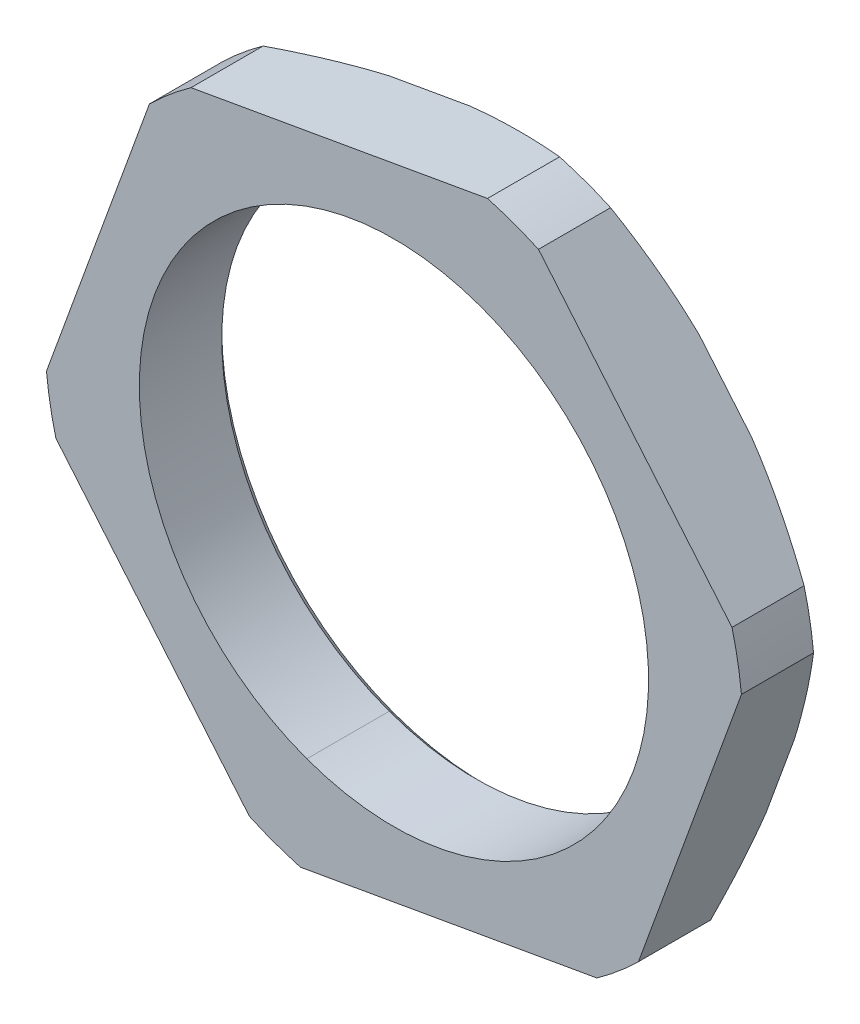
ISO-10303-21;
HEADER;
FILE_DESCRIPTION(('STEP AP214'),'2;1');
FILE_NAME('part.step','',(''),(''),'','','');
FILE_SCHEMA(('AUTOMOTIVE_DESIGN { 1 0 10303 214 1 1 1 1 }'));
ENDSEC;
DATA;
#1=APPLICATION_CONTEXT('core data for automotive mechanical design processes');
#2=APPLICATION_PROTOCOL_DEFINITION('international standard','automotive_design',2000,#1);
#3=PRODUCT_CONTEXT('',#1,'mechanical');
#4=PRODUCT('Part','Part','',(#3));
#5=PRODUCT_RELATED_PRODUCT_CATEGORY('part','',(#4));
#6=PRODUCT_DEFINITION_FORMATION('','',#4);
#7=PRODUCT_DEFINITION_CONTEXT('part definition',#1,'design');
#8=PRODUCT_DEFINITION('design','',#6,#7);
#9=PRODUCT_DEFINITION_SHAPE('','',#8);
#10=(LENGTH_UNIT() NAMED_UNIT(*) SI_UNIT(.MILLI.,.METRE.));
#11=(NAMED_UNIT(*) PLANE_ANGLE_UNIT() SI_UNIT($,.RADIAN.));
#12=(NAMED_UNIT(*) SI_UNIT($,.STERADIAN.) SOLID_ANGLE_UNIT());
#13=UNCERTAINTY_MEASURE_WITH_UNIT(LENGTH_MEASURE(1.E-05),#10,'distance_accuracy_value','');
#14=(GEOMETRIC_REPRESENTATION_CONTEXT(3) GLOBAL_UNCERTAINTY_ASSIGNED_CONTEXT((#13)) GLOBAL_UNIT_ASSIGNED_CONTEXT((#10,
#11,#12)) REPRESENTATION_CONTEXT('',''));
#15=CARTESIAN_POINT('',(0.,0.,0.));
#16=DIRECTION('',(0.,0.,1.));
#17=DIRECTION('',(1.,0.,0.));
#18=AXIS2_PLACEMENT_3D('',#15,#16,#17);
#19=CARTESIAN_POINT('',(0.,0.,-2.69733218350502));
#20=DIRECTION('',(0.,0.,1.));
#21=DIRECTION('',(-0.342020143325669,-0.939692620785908,0.));
#22=AXIS2_PLACEMENT_3D('',#19,#20,#21);
#23=CONICAL_SURFACE('',#22,50.,1.0471975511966);
#24=CARTESIAN_POINT('',(25.4760200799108,16.3105763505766,-14.1));
#25=CARTESIAN_POINT('',(25.7559586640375,15.9769188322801,-14.067765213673));
#26=CARTESIAN_POINT('',(26.0356091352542,15.6435416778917,-14.030217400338));
#27=CARTESIAN_POINT('',(26.5950178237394,14.9766788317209,-13.9446695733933));
#28=CARTESIAN_POINT('',(26.8747743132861,14.6431952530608,-13.8966417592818));
#29=CARTESIAN_POINT('',(27.4353780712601,13.9750956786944,-13.7901413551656));
#30=CARTESIAN_POINT('',(27.7162207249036,13.6404862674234,-13.731603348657));
#31=CARTESIAN_POINT('',(28.279807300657,12.9690262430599,-13.6041345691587));
#32=CARTESIAN_POINT('',(28.5625421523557,12.6321866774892,-13.5351057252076));
#33=CARTESIAN_POINT('',(29.1218936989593,11.9656089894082,-13.3889431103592));
#34=CARTESIAN_POINT('',(29.398529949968,11.6358508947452,-13.3119748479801));
#35=CARTESIAN_POINT('',(29.9532288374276,10.9746801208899,-13.1486224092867));
#36=CARTESIAN_POINT('',(30.2312821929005,10.6432789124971,-13.0621603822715));
#37=CARTESIAN_POINT('',(30.789461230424,9.9780767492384,-12.8798473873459));
#38=CARTESIAN_POINT('',(31.0695743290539,9.64429159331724,-12.7839004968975));
#39=CARTESIAN_POINT('',(31.6324375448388,8.97358394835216,-12.5826361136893));
#40=CARTESIAN_POINT('',(31.9151714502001,8.63668084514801,-12.4772085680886));
#41=CARTESIAN_POINT('',(32.1972691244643,8.30050365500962,-12.3679491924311));
#42=B_SPLINE_CURVE_WITH_KNOTS('',3,(#24,#25,#26,#27,#28,#29,#30,#31,#32,#33,#34,#35,#36,#37,#38,
#39,#40,#41),.UNSPECIFIED.,.F.,.F.,(4,2,2,2,2,2,2,2,4),(0.,1.31014422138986,2.6238070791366,
3.94594918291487,5.28131229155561,6.59298565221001,7.91635666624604,9.25483645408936,
10.6115906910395),.UNSPECIFIED.);
#43=CARTESIAN_POINT('',(25.4760200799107,16.3105763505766,-14.1));
#44=VERTEX_POINT('',#43);
#45=CARTESIAN_POINT('',(32.1972691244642,8.30050365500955,-12.3679491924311));
#46=VERTEX_POINT('',#45);
#47=EDGE_CURVE('E640',#44,#46,#42,.T.);
#48=ORIENTED_EDGE('',*,*,#47,.T.);
#49=CARTESIAN_POINT('',(0.,0.,-12.3679491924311));
#50=DIRECTION('',(0.,0.,-1.));
#51=DIRECTION('',(-0.342020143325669,-0.939692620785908,0.));
#52=AXIS2_PLACEMENT_3D('',#49,#50,#51);
#53=CIRCLE('',#52,33.25);
#54=CARTESIAN_POINT('',(33.0944756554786,3.21219256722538,-12.3679491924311));
#55=VERTEX_POINT('',#54);
#56=EDGE_CURVE('E637',#46,#55,#53,.T.);
#57=ORIENTED_EDGE('',*,*,#56,.T.);
#58=CARTESIAN_POINT('',(33.0944756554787,3.21219256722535,-12.3679491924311));
#59=CARTESIAN_POINT('',(32.9456044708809,2.80319737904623,-12.47630999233));
#60=CARTESIAN_POINT('',(32.7963902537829,2.39331699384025,-12.5809012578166));
#61=CARTESIAN_POINT('',(32.4993249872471,1.57729108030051,-12.7806547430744));
#62=CARTESIAN_POINT('',(32.3514823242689,1.17116871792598,-12.8759241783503));
#63=CARTESIAN_POINT('',(32.0568922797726,0.361804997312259,-13.057043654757));
#64=CARTESIAN_POINT('',(31.9101511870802,-0.0414176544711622,-13.1429872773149));
#65=CARTESIAN_POINT('',(31.6174248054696,-0.845868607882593,-13.3054636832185));
#66=CARTESIAN_POINT('',(31.4714442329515,-1.24708322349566,-13.382072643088));
#67=CARTESIAN_POINT('',(31.1737746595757,-2.06485527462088,-13.5288749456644));
#68=CARTESIAN_POINT('',(31.0220635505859,-2.48146144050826,-13.5987528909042));
#69=CARTESIAN_POINT('',(30.7196733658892,-3.31188971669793,-13.7277496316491));
#70=CARTESIAN_POINT('',(30.5689991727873,-3.72569791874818,-13.7869691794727));
#71=CARTESIAN_POINT('',(30.2682971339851,-4.55186824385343,-13.8946628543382));
#72=CARTESIAN_POINT('',(30.1182714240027,-4.9642223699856,-13.9432041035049));
#73=CARTESIAN_POINT('',(29.8182806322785,-5.78880227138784,-14.0296110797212));
#74=CARTESIAN_POINT('',(29.6683164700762,-6.20102541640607,-14.0675051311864));
#75=CARTESIAN_POINT('',(29.5181737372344,-6.61361619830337,-14.1));
#76=B_SPLINE_CURVE_WITH_KNOTS('',3,(#58,#59,#60,#61,#62,#63,#64,#65,#66,#67,#68,#69,#70,#71,#72,
#73,#74,#75),.UNSPECIFIED.,.F.,.F.,(4,2,2,2,2,2,2,2,4),(0.,1.34559695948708,2.6732346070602,
3.98599636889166,5.28720306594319,6.63362056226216,7.96655250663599,9.29084993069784,
10.6115902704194),.UNSPECIFIED.);
#77=CARTESIAN_POINT('',(29.5181737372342,-6.6136161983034,-14.1));
#78=VERTEX_POINT('',#77);
#79=EDGE_CURVE('E462',#55,#78,#76,.T.);
#80=ORIENTED_EDGE('',*,*,#79,.T.);
#81=CARTESIAN_POINT('',(0.,0.,-14.1));
#82=DIRECTION('',(0.,0.,1.));
#83=DIRECTION('',(-0.342020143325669,-0.939692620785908,0.));
#84=AXIS2_PLACEMENT_3D('',#81,#82,#83);
#85=CIRCLE('',#84,30.25);
#86=EDGE_CURVE('E437',#78,#44,#85,.T.);
#87=ORIENTED_EDGE('',*,*,#86,.T.);
#88=EDGE_LOOP('',(#48,#57,#80,#87));
#89=FACE_BOUND('',#88,.T.);
#90=ADVANCED_FACE('F15',(#89),#23,.T.);
#91=CARTESIAN_POINT('',(0.,0.,-2.69733218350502));
#92=DIRECTION('',(0.,0.,1.));
#93=DIRECTION('',(-0.342020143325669,-0.939692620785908,0.));
#94=AXIS2_PLACEMENT_3D('',#91,#92,#93);
#95=CONICAL_SURFACE('',#94,50.,1.0471975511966);
#96=CARTESIAN_POINT('',(26.8633835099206,-13.9075924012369,-14.1));
#97=CARTESIAN_POINT('',(26.7143484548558,-14.3169882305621,-14.0677546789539));
#98=CARTESIAN_POINT('',(26.565432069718,-14.7260000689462,-14.0301811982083));
#99=CARTESIAN_POINT('',(26.2675209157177,-15.5443352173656,-13.9445478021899));
#100=CARTESIAN_POINT('',(26.1185273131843,-15.9536556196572,-13.8964560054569));
#101=CARTESIAN_POINT('',(25.8200440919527,-16.773971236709,-13.7897932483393));
#102=CARTESIAN_POINT('',(25.6705580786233,-17.1849586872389,-13.7311526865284));
#103=CARTESIAN_POINT('',(25.3705086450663,-18.00986348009,-13.6034459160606));
#104=CARTESIAN_POINT('',(25.2199502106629,-18.423766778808,-13.5342775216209));
#105=CARTESIAN_POINT('',(24.9221858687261,-19.2418917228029,-13.3879763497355));
#106=CARTESIAN_POINT('',(24.7749723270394,-19.6461435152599,-13.3110272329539));
#107=CARTESIAN_POINT('',(24.4798568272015,-20.4565890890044,-13.1477521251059));
#108=CARTESIAN_POINT('',(24.3319598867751,-20.8627695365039,-13.0613509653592));
#109=CARTESIAN_POINT('',(24.0351699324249,-21.6780018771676,-12.8792000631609));
#110=CARTESIAN_POINT('',(23.8862841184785,-22.0870355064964,-12.783357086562));
#111=CARTESIAN_POINT('',(23.5871779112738,-22.9088309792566,-12.5823409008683));
#112=CARTESIAN_POINT('',(23.4369662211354,-23.3215697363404,-12.4770602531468));
#113=CARTESIAN_POINT('',(23.2870815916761,-23.7334011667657,-12.3679491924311));
#114=B_SPLINE_CURVE_WITH_KNOTS('',3,(#96,#97,#98,#99,#100,#101,#102,#103,#104,#105,#106,#107,
#108,#109,#110,#111,#112,#113),.UNSPECIFIED.,.F.,.F.,(4,2,2,2,2,2,2,2,4),(0.,1.31056980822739,
2.62516846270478,3.94878225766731,5.28617624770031,6.59723374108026,7.91960194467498,
9.25666808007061,10.6115764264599),.UNSPECIFIED.);
#115=CARTESIAN_POINT('',(26.8633835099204,-13.9075924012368,-14.1));
#116=VERTEX_POINT('',#115);
#117=CARTESIAN_POINT('',(23.287081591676,-23.7334011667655,-12.3679491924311));
#118=VERTEX_POINT('',#117);
#119=EDGE_CURVE('E461',#116,#118,#114,.T.);
#120=ORIENTED_EDGE('',*,*,#119,.T.);
#121=CARTESIAN_POINT('',(0.,0.,-12.3679491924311));
#122=DIRECTION('',(0.,0.,-1.));
#123=DIRECTION('',(-0.342020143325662,-0.939692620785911,0.));
#124=AXIS2_PLACEMENT_3D('',#121,#122,#123);
#125=CIRCLE('',#124,33.25);
#126=CARTESIAN_POINT('',(19.3290781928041,-27.0545603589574,-12.3679491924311));
#127=VERTEX_POINT('',#126);
#128=EDGE_CURVE('E518',#118,#127,#125,.T.);
#129=ORIENTED_EDGE('',*,*,#128,.T.);
#130=CARTESIAN_POINT('',(19.3290781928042,-27.0545603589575,-12.3679491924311));
#131=CARTESIAN_POINT('',(18.8989533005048,-27.130394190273,-12.4766864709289));
#132=CARTESIAN_POINT('',(18.4678836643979,-27.2063743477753,-12.5816281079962));
#133=CARTESIAN_POINT('',(17.6096883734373,-27.3576429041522,-12.7820151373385));
#134=CARTESIAN_POINT('',(17.1825872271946,-27.4329269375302,-12.8775688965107));
#135=CARTESIAN_POINT('',(16.3314459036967,-27.5830006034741,-13.0591899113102));
#136=CARTESIAN_POINT('',(15.907425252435,-27.6577862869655,-13.145351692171));
#137=CARTESIAN_POINT('',(15.061496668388,-27.8070137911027,-13.3081976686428));
#138=CARTESIAN_POINT('',(14.6396030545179,-27.8814528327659,-13.3849587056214));
#139=CARTESIAN_POINT('',(13.7825947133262,-28.0325432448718,-13.5314930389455));
#140=CARTESIAN_POINT('',(13.3474374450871,-28.1091987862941,-13.6010139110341));
#141=CARTESIAN_POINT('',(12.4800238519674,-28.262016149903,-13.7293681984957));
#142=CARTESIAN_POINT('',(12.0477818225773,-28.3381752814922,-13.7883011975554));
#143=CARTESIAN_POINT('',(11.1848599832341,-28.4903311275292,-13.8954933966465));
#144=CARTESIAN_POINT('',(10.7541880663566,-28.5663257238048,-13.9438189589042));
#145=CARTESIAN_POINT('',(9.89298631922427,-28.7183029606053,-14.0298652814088));
#146=CARTESIAN_POINT('',(9.46245919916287,-28.7942850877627,-14.0676141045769));
#147=CARTESIAN_POINT('',(9.03152723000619,-28.8702964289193,-14.1));
#148=B_SPLINE_CURVE_WITH_KNOTS('',3,(#130,#131,#132,#133,#134,#135,#136,#137,#138,#139,#140,
#141,#142,#143,#144,#145,#146,#147),.UNSPECIFIED.,.F.,.F.,(4,2,2,2,2,2,2,2,4),(0.,
1.35027160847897,2.6824575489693,3.99967535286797,5.30528327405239,6.64705256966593,
7.97545305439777,9.29528964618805,10.611590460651),.UNSPECIFIED.);
#149=CARTESIAN_POINT('',(9.03152723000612,-28.8702964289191,-14.1));
#150=VERTEX_POINT('',#149);
#151=EDGE_CURVE('E325',#127,#150,#148,.T.);
#152=ORIENTED_EDGE('',*,*,#151,.T.);
#153=CARTESIAN_POINT('',(0.,0.,-14.1));
#154=DIRECTION('',(0.,0.,1.));
#155=DIRECTION('',(-0.342020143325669,-0.939692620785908,0.));
#156=AXIS2_PLACEMENT_3D('',#153,#154,#155);
#157=CIRCLE('',#156,30.25);
#158=EDGE_CURVE('E424',#150,#116,#157,.T.);
#159=ORIENTED_EDGE('',*,*,#158,.T.);
#160=EDGE_LOOP('',(#120,#129,#152,#159));
#161=FACE_BOUND('',#160,.T.);
#162=ADVANCED_FACE('F545',(#161),#95,.T.);
#163=CARTESIAN_POINT('',(0.,0.,-2.69733218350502));
#164=DIRECTION('',(0.,0.,1.));
#165=DIRECTION('',(-0.342020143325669,-0.939692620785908,0.));
#166=AXIS2_PLACEMENT_3D('',#163,#164,#165);
#167=CONICAL_SURFACE('',#166,50.,1.0471975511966);
#168=CARTESIAN_POINT('',(13.7653974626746,30.2667529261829,-12.3679491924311));
#169=CARTESIAN_POINT('',(14.046133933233,29.9321707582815,-12.476686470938));
#170=CARTESIAN_POINT('',(14.3274694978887,29.5968435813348,-12.5816281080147));
#171=CARTESIAN_POINT('',(14.887569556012,28.9292589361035,-12.7820151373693));
#172=CARTESIAN_POINT('',(15.1663180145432,28.5970205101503,-12.8775688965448));
#173=CARTESIAN_POINT('',(15.7218562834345,27.9349473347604,-13.0591899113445));
#174=CARTESIAN_POINT('',(15.9986329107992,27.6051275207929,-13.1453516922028));
#175=CARTESIAN_POINT('',(16.5508320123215,26.9471456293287,-13.3081976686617));
#176=CARTESIAN_POINT('',(16.8262449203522,26.6189945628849,-13.3849587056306));
#177=CARTESIAN_POINT('',(17.3855972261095,25.9523487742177,-13.5314930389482));
#178=CARTESIAN_POINT('',(17.6695615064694,25.6138192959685,-13.6010139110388));
#179=CARTESIAN_POINT('',(18.235612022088,24.9390257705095,-13.7293681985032));
#180=CARTESIAN_POINT('',(18.5176887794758,24.6027727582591,-13.7883011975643));
#181=CARTESIAN_POINT('',(19.0809205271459,23.9315384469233,-13.8954933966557));
#182=CARTESIAN_POINT('',(19.3620697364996,23.5965629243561,-13.9438189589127));
#183=CARTESIAN_POINT('',(19.9242867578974,22.9267289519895,-14.0298652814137));
#184=CARTESIAN_POINT('',(20.2053527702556,22.5918725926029,-14.0676141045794));
#185=CARTESIAN_POINT('',(20.4866465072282,22.2566802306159,-14.1));
#186=B_SPLINE_CURVE_WITH_KNOTS('',3,(#168,#169,#170,#171,#172,#173,#174,#175,#176,#177,#178,
#179,#180,#181,#182,#183,#184,#185),.UNSPECIFIED.,.F.,.F.,(4,2,2,2,2,2,2,2,4),(0.,
1.35027160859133,2.68245754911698,3.99967535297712,5.30528327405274,6.64705256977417,
7.9754530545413,9.29528964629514,10.611590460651),.UNSPECIFIED.);
#187=CARTESIAN_POINT('',(13.7653974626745,30.2667529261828,-12.3679491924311));
#188=VERTEX_POINT('',#187);
#189=CARTESIAN_POINT('',(20.4866465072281,22.2566802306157,-14.1));
#190=VERTEX_POINT('',#189);
#191=EDGE_CURVE('E645',#188,#190,#186,.T.);
#192=ORIENTED_EDGE('',*,*,#191,.T.);
#193=CARTESIAN_POINT('',(0.,0.,-14.1));
#194=DIRECTION('',(0.,0.,1.));
#195=DIRECTION('',(-0.342020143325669,-0.939692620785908,0.));
#196=AXIS2_PLACEMENT_3D('',#193,#194,#195);
#197=CIRCLE('',#196,30.25);
#198=CARTESIAN_POINT('',(-1.38736343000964,30.2181687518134,-14.1));
#199=VERTEX_POINT('',#198);
#200=EDGE_CURVE('E698',#190,#199,#197,.T.);
#201=ORIENTED_EDGE('',*,*,#200,.T.);
#202=CARTESIAN_POINT('',(-1.38736343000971,30.2181687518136,-14.1));
#203=CARTESIAN_POINT('',(-0.958438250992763,30.293773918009,-14.067765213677));
#204=CARTESIAN_POINT('',(-0.52989993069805,30.3692697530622,-14.0302174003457));
#205=CARTESIAN_POINT('',(0.327324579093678,30.5203004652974,-13.9446695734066));
#206=CARTESIAN_POINT('',(0.756008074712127,30.5958349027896,-13.8966417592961));
#207=CARTESIAN_POINT('',(1.61490115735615,30.7472822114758,-13.7901413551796));
#208=CARTESIAN_POINT('',(2.04510273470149,30.8231943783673,-13.7316033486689));
#209=CARTESIAN_POINT('',(2.90839746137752,30.9755446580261,-13.6041345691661));
#210=CARTESIAN_POINT('',(3.34147650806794,31.0519804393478,-13.5351057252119));
#211=CARTESIAN_POINT('',(4.1984254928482,31.2031042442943,-13.3889431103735));
#212=CARTESIAN_POINT('',(4.6223225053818,31.2777992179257,-13.3119748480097));
#213=CARTESIAN_POINT('',(5.47226263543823,31.4275971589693,-13.1486224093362));
#214=CARTESIAN_POINT('',(5.89829117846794,31.5026978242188,-13.062160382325));
#215=CARTESIAN_POINT('',(6.75346266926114,31.6534939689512,-12.879847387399));
#216=CARTESIAN_POINT('',(7.18258564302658,31.7291864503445,-12.7839004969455));
#217=CARTESIAN_POINT('',(8.04486711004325,31.8812864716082,-12.5826361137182));
#218=CARTESIAN_POINT('',(8.47800070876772,31.957689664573,-12.4772085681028));
#219=CARTESIAN_POINT('',(8.91018753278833,32.0339048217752,-12.3679491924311));
#220=B_SPLINE_CURVE_WITH_KNOTS('',3,(#202,#203,#204,#205,#206,#207,#208,#209,#210,#211,#212,
#213,#214,#215,#216,#217,#218,#219),.UNSPECIFIED.,.F.,.F.,(4,2,2,2,2,2,2,2,4),(0.,
1.31014422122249,2.62380707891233,3.94594918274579,5.28131229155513,6.59298565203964,
7.91635666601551,9.25483645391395,10.6115906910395),.UNSPECIFIED.);
#221=CARTESIAN_POINT('',(8.91018753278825,32.0339048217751,-12.3679491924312));
#222=VERTEX_POINT('',#221);
#223=EDGE_CURVE('E238',#199,#222,#220,.T.);
#224=ORIENTED_EDGE('',*,*,#223,.T.);
#225=CARTESIAN_POINT('',(0.,0.,-12.3679491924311));
#226=DIRECTION('',(0.,0.,-1.));
#227=DIRECTION('',(-0.342020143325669,-0.939692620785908,0.));
#228=AXIS2_PLACEMENT_3D('',#225,#226,#227);
#229=CIRCLE('',#228,33.25);
#230=EDGE_CURVE('E427',#222,#188,#229,.T.);
#231=ORIENTED_EDGE('',*,*,#230,.T.);
#232=EDGE_LOOP('',(#192,#201,#224,#231));
#233=FACE_BOUND('',#232,.T.);
#234=ADVANCED_FACE('F553',(#233),#167,.T.);
#235=CARTESIAN_POINT('',(0.,0.,-2.69733218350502));
#236=DIRECTION('',(0.,0.,1.));
#237=DIRECTION('',(-0.342020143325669,-0.939692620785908,0.));
#238=AXIS2_PLACEMENT_3D('',#235,#236,#237);
#239=CONICAL_SURFACE('',#238,50.,1.0471975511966);
#240=CARTESIAN_POINT('',(-19.3290781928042,27.0545603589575,-12.3679491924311));
#241=CARTESIAN_POINT('',(-18.8989533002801,27.1303941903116,-12.4766864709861));
#242=CARTESIAN_POINT('',(-18.4678836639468,27.2063743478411,-12.5816281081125));
#243=CARTESIAN_POINT('',(-17.6096883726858,27.3576429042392,-12.7820151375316));
#244=CARTESIAN_POINT('',(-17.1825872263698,27.4329269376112,-12.8775688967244));
#245=CARTESIAN_POINT('',(-16.3314459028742,27.5830006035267,-13.0591899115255));
#246=CARTESIAN_POINT('',(-15.9074252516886,27.6577862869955,-13.1453516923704));
#247=CARTESIAN_POINT('',(-15.0614966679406,27.8070137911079,-13.3081976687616));
#248=CARTESIAN_POINT('',(-14.6396030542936,27.8814528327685,-13.3849587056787));
#249=CARTESIAN_POINT('',(-13.78259471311,28.0325432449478,-13.531493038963));
#250=CARTESIAN_POINT('',(-13.347437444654,28.1091987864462,-13.6010139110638));
#251=CARTESIAN_POINT('',(-12.4800238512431,28.2620161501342,-13.7293681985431));
#252=CARTESIAN_POINT('',(-12.0477818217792,28.3381752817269,-13.7883011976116));
#253=CARTESIAN_POINT('',(-11.1848599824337,28.4903311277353,-13.895493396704));
#254=CARTESIAN_POINT('',(-10.754188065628,28.5663257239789,-13.9438189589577));
#255=CARTESIAN_POINT('',(-9.89298631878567,28.7183029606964,-14.0298652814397));
#256=CARTESIAN_POINT('',(-9.46245919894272,28.7942850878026,-14.0676141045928));
#257=CARTESIAN_POINT('',(-9.0315272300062,28.8702964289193,-14.1));
#258=B_SPLINE_CURVE_WITH_KNOTS('',3,(#240,#241,#242,#243,#244,#245,#246,#247,#248,#249,#250,
#251,#252,#253,#254,#255,#256,#257),.UNSPECIFIED.,.F.,.F.,(4,2,2,2,2,2,2,2,4),(0.,
1.35027160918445,2.68245754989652,3.99967535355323,5.30528327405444,6.64705257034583,
7.97545305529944,9.29528964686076,10.6115904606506),.UNSPECIFIED.);
#259=CARTESIAN_POINT('',(-19.3290781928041,27.0545603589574,-12.3679491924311));
#260=VERTEX_POINT('',#259);
#261=CARTESIAN_POINT('',(-9.03152723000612,28.8702964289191,-14.1));
#262=VERTEX_POINT('',#261);
#263=EDGE_CURVE('E526',#260,#262,#258,.T.);
#264=ORIENTED_EDGE('',*,*,#263,.T.);
#265=CARTESIAN_POINT('',(0.,0.,-14.1));
#266=DIRECTION('',(0.,0.,1.));
#267=DIRECTION('',(-0.342020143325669,-0.939692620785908,0.));
#268=AXIS2_PLACEMENT_3D('',#265,#266,#267);
#269=CIRCLE('',#268,30.25);
#270=CARTESIAN_POINT('',(-26.8633835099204,13.9075924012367,-14.1));
#271=VERTEX_POINT('',#270);
#272=EDGE_CURVE('E212',#262,#271,#269,.T.);
#273=ORIENTED_EDGE('',*,*,#272,.T.);
#274=CARTESIAN_POINT('',(-26.8633835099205,13.9075924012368,-14.1));
#275=CARTESIAN_POINT('',(-26.7143484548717,14.316988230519,-14.0677546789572));
#276=CARTESIAN_POINT('',(-26.565432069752,14.7260000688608,-14.0301811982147));
#277=CARTESIAN_POINT('',(-26.2675209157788,15.5443352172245,-13.9445478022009));
#278=CARTESIAN_POINT('',(-26.1185273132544,15.9536556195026,-13.8964560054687));
#279=CARTESIAN_POINT('',(-25.8200440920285,16.773971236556,-13.7897932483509));
#280=CARTESIAN_POINT('',(-25.6705580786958,17.1849586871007,-13.7311526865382));
#281=CARTESIAN_POINT('',(-25.3705086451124,18.0098634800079,-13.6034459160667));
#282=CARTESIAN_POINT('',(-25.219950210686,18.423766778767,-13.5342775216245));
#283=CARTESIAN_POINT('',(-24.9221858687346,19.2418917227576,-13.3879763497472));
#284=CARTESIAN_POINT('',(-24.7749723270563,19.6461435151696,-13.3110272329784));
#285=CARTESIAN_POINT('',(-24.4798568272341,20.4565890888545,-13.1477521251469));
#286=CARTESIAN_POINT('',(-24.331959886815,20.8627695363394,-13.0613509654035));
#287=CARTESIAN_POINT('',(-24.0351699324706,21.6780018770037,-12.8792000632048));
#288=CARTESIAN_POINT('',(-23.8862841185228,22.0870355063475,-12.7833570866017));
#289=CARTESIAN_POINT('',(-23.5871779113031,22.9088309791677,-12.5823409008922));
#290=CARTESIAN_POINT('',(-23.4369662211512,23.3215697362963,-12.4770602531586));
#291=CARTESIAN_POINT('',(-23.2870815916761,23.7334011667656,-12.3679491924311));
#292=B_SPLINE_CURVE_WITH_KNOTS('',3,(#274,#275,#276,#277,#278,#279,#280,#281,#282,#283,#284,
#285,#286,#287,#288,#289,#290,#291),.UNSPECIFIED.,.F.,.F.,(4,2,2,2,2,2,2,2,4),(0.,
1.31056980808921,2.62516846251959,3.94878225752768,5.28617624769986,6.59723374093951,
7.9196019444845,9.25666807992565,10.6115764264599),.UNSPECIFIED.);
#293=CARTESIAN_POINT('',(-23.287081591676,23.7334011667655,-12.3679491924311));
#294=VERTEX_POINT('',#293);
#295=EDGE_CURVE('E204',#271,#294,#292,.T.);
#296=ORIENTED_EDGE('',*,*,#295,.T.);
#297=CARTESIAN_POINT('',(0.,0.,-12.3679491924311));
#298=DIRECTION('',(0.,0.,-1.));
#299=DIRECTION('',(-0.342020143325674,-0.939692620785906,0.));
#300=AXIS2_PLACEMENT_3D('',#297,#298,#299);
#301=CIRCLE('',#300,33.25);
#302=EDGE_CURVE('E209',#294,#260,#301,.T.);
#303=ORIENTED_EDGE('',*,*,#302,.T.);
#304=EDGE_LOOP('',(#264,#273,#296,#303));
#305=FACE_BOUND('',#304,.T.);
#306=ADVANCED_FACE('F207',(#305),#239,.T.);
#307=CARTESIAN_POINT('',(0.,0.,-2.69733218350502));
#308=DIRECTION('',(0.,0.,1.));
#309=DIRECTION('',(-0.342020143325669,-0.939692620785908,0.));
#310=AXIS2_PLACEMENT_3D('',#307,#308,#309);
#311=CONICAL_SURFACE('',#310,50.,1.0471975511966);
#312=DIRECTION('',(-0.296198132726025,-0.813797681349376,0.5));
#313=VECTOR('',#312,1.);
#314=CARTESIAN_POINT('',(-17.1010071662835,-46.9846310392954,-2.69733218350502));
#315=LINE('',#314,#313);
#316=CARTESIAN_POINT('',(-10.3461093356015,-28.4257017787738,-14.1));
#317=VERTEX_POINT('',#316);
#318=CARTESIAN_POINT('',(-11.3721697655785,-31.2447796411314,-12.3679491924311));
#319=VERTEX_POINT('',#318);
#320=EDGE_CURVE('E334',#317,#319,#315,.T.);
#321=ORIENTED_EDGE('',*,*,#320,.F.);
#322=CARTESIAN_POINT('',(0.,0.,-14.1));
#323=DIRECTION('',(0.,0.,1.));
#324=DIRECTION('',(-0.342020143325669,-0.939692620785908,0.));
#325=AXIS2_PLACEMENT_3D('',#322,#323,#324);
#326=CIRCLE('',#325,30.25);
#327=CARTESIAN_POINT('',(1.38736343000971,-30.2181687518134,-14.1));
#328=VERTEX_POINT('',#327);
#329=EDGE_CURVE('E579',#317,#328,#326,.T.);
#330=ORIENTED_EDGE('',*,*,#329,.T.);
#331=CARTESIAN_POINT('',(1.38736343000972,-30.2181687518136,-14.1));
#332=CARTESIAN_POINT('',(0.958438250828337,-30.2937739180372,-14.0677652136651));
#333=CARTESIAN_POINT('',(0.529899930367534,-30.3692697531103,-14.0302174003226));
#334=CARTESIAN_POINT('',(-0.327324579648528,-30.5203004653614,-13.9446695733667));
#335=CARTESIAN_POINT('',(-0.756008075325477,-30.5958349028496,-13.8966417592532));
#336=CARTESIAN_POINT('',(-1.61490115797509,-30.7472822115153,-13.7901413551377));
#337=CARTESIAN_POINT('',(-2.04510273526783,-30.8231943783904,-13.7316033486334));
#338=CARTESIAN_POINT('',(-2.90839746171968,-30.9755446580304,-13.6041345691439));
#339=CARTESIAN_POINT('',(-3.34147650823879,-31.0519804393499,-13.5351057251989));
#340=CARTESIAN_POINT('',(-4.1984254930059,-31.2031042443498,-13.3889431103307));
#341=CARTESIAN_POINT('',(-4.62232250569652,-31.2777992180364,-13.3119748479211));
#342=CARTESIAN_POINT('',(-5.47226263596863,-31.427597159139,-13.1486224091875));
#343=CARTESIAN_POINT('',(-5.8982911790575,-31.502697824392,-13.0621603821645));
#344=CARTESIAN_POINT('',(-6.75346266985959,-31.653493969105,-12.8798473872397));
#345=CARTESIAN_POINT('',(-7.18258564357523,-31.7291864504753,-12.7839004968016));
#346=CARTESIAN_POINT('',(-8.04486711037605,-31.8812864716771,-12.5826361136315));
#347=CARTESIAN_POINT('',(-8.47800070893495,-31.9576896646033,-12.4772085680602));
#348=CARTESIAN_POINT('',(-8.91018753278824,-32.0339048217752,-12.3679491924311));
#349=B_SPLINE_CURVE_WITH_KNOTS('',3,(#331,#332,#333,#334,#335,#336,#337,#338,#339,#340,#341,
#342,#343,#344,#345,#346,#347,#348),.UNSPECIFIED.,.F.,.F.,(4,2,2,2,2,2,2,2,4),(0.,
1.31014422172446,2.62380707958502,3.9459491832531,5.28131229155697,6.59298565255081,
7.9163566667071,9.25483645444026,10.6115906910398),.UNSPECIFIED.);
#350=CARTESIAN_POINT('',(-8.9101875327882,-32.0339048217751,-12.3679491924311));
#351=VERTEX_POINT('',#350);
#352=EDGE_CURVE('E527',#328,#351,#349,.T.);
#353=ORIENTED_EDGE('',*,*,#352,.T.);
#354=CARTESIAN_POINT('',(0.,0.,-12.3679491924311));
#355=DIRECTION('',(0.,0.,-1.));
#356=DIRECTION('',(-0.342020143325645,-0.939692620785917,0.));
#357=AXIS2_PLACEMENT_3D('',#354,#355,#356);
#358=CIRCLE('',#357,33.25);
#359=EDGE_CURVE('E568',#351,#319,#358,.T.);
#360=ORIENTED_EDGE('',*,*,#359,.T.);
#361=EDGE_LOOP('',(#321,#330,#353,#360));
#362=FACE_BOUND('',#361,.T.);
#363=ADVANCED_FACE('F268',(#362),#311,.T.);
#364=CARTESIAN_POINT('',(0.,0.,-2.69733218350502));
#365=DIRECTION('',(0.,0.,1.));
#366=DIRECTION('',(-0.342020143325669,-0.939692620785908,0.));
#367=AXIS2_PLACEMENT_3D('',#364,#365,#366);
#368=CONICAL_SURFACE('',#367,50.,1.0471975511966);
#369=CARTESIAN_POINT('',(-33.0944756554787,-3.21219256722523,-12.3679491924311));
#370=CARTESIAN_POINT('',(-32.9456044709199,-2.80319737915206,-12.4763099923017));
#371=CARTESIAN_POINT('',(-32.7963902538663,-2.39331699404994,-12.580901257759));
#372=CARTESIAN_POINT('',(-32.4993249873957,-1.57729108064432,-12.7806547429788));
#373=CARTESIAN_POINT('',(-32.3514823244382,-1.17116871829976,-12.8759241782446));
#374=CARTESIAN_POINT('',(-32.0568922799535,-0.361804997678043,-13.0570436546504));
#375=CARTESIAN_POINT('',(-31.910151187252,0.0414176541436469,-13.1429872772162));
#376=CARTESIAN_POINT('',(-31.617424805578,0.845868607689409,-13.3054636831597));
#377=CARTESIAN_POINT('',(-31.4714442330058,1.24708322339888,-13.3820726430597));
#378=CARTESIAN_POINT('',(-31.1737746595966,2.06485527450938,-13.5288749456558));
#379=CARTESIAN_POINT('',(-31.0220635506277,2.4814614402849,-13.5987528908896));
#380=CARTESIAN_POINT('',(-30.7196733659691,3.3118897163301,-13.7277496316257));
#381=CARTESIAN_POINT('',(-30.568999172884,3.72569791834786,-13.786969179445));
#382=CARTESIAN_POINT('',(-30.2682971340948,4.55186824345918,-13.8946628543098));
#383=CARTESIAN_POINT('',(-30.1182714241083,4.96422236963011,-13.9432041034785));
#384=CARTESIAN_POINT('',(-29.8182806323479,5.78880227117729,-14.0296110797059));
#385=CARTESIAN_POINT('',(-29.6683164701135,6.20102541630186,-14.0675051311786));
#386=CARTESIAN_POINT('',(-29.5181737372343,6.61361619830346,-14.1));
#387=B_SPLINE_CURVE_WITH_KNOTS('',3,(#369,#370,#371,#372,#373,#374,#375,#376,#377,#378,#379,
#380,#381,#382,#383,#384,#385,#386),.UNSPECIFIED.,.F.,.F.,(4,2,2,2,2,2,2,2,4),(0.,
1.34559695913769,2.67323460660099,3.98599636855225,5.28720306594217,6.63362056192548,
7.96655250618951,9.29084993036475,10.6115902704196),.UNSPECIFIED.);
#388=CARTESIAN_POINT('',(-33.0944756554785,-3.21219256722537,-12.3679491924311));
#389=VERTEX_POINT('',#388);
#390=CARTESIAN_POINT('',(-29.5181737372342,6.61361619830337,-14.1));
#391=VERTEX_POINT('',#390);
#392=EDGE_CURVE('E232',#389,#391,#387,.T.);
#393=ORIENTED_EDGE('',*,*,#392,.T.);
#394=CARTESIAN_POINT('',(0.,0.,-14.1));
#395=DIRECTION('',(0.,0.,1.));
#396=DIRECTION('',(-0.342020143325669,-0.939692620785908,0.));
#397=AXIS2_PLACEMENT_3D('',#394,#395,#396);
#398=CIRCLE('',#397,30.25);
#399=CARTESIAN_POINT('',(-25.4760200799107,-16.3105763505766,-14.1));
#400=VERTEX_POINT('',#399);
#401=EDGE_CURVE('E292',#391,#400,#398,.T.);
#402=ORIENTED_EDGE('',*,*,#401,.T.);
#403=CARTESIAN_POINT('',(-25.4760200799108,-16.3105763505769,-14.0999999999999));
#404=CARTESIAN_POINT('',(-25.7559586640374,-15.9769188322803,-14.067765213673));
#405=CARTESIAN_POINT('',(-26.0356091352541,-15.6435416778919,-14.030217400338));
#406=CARTESIAN_POINT('',(-26.5950178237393,-14.9766788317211,-13.9446695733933));
#407=CARTESIAN_POINT('',(-26.8747743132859,-14.643195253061,-13.8966417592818));
#408=CARTESIAN_POINT('',(-27.43537807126,-13.9750956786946,-13.7901413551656));
#409=CARTESIAN_POINT('',(-27.7162207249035,-13.6404862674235,-13.7316033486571));
#410=CARTESIAN_POINT('',(-28.2798073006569,-12.96902624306,-13.6041345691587));
#411=CARTESIAN_POINT('',(-28.5625421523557,-12.6321866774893,-13.5351057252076));
#412=CARTESIAN_POINT('',(-29.1218936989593,-11.9656089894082,-13.3889431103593));
#413=CARTESIAN_POINT('',(-29.398529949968,-11.6358508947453,-13.3119748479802));
#414=CARTESIAN_POINT('',(-29.9532288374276,-10.9746801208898,-13.1486224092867));
#415=CARTESIAN_POINT('',(-30.2312821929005,-10.6432789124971,-13.0621603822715));
#416=CARTESIAN_POINT('',(-30.789461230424,-9.97807674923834,-12.8798473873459));
#417=CARTESIAN_POINT('',(-31.0695743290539,-9.64429159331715,-12.7839004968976));
#418=CARTESIAN_POINT('',(-31.6324375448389,-8.97358394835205,-12.5826361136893));
#419=CARTESIAN_POINT('',(-31.9151714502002,-8.6366808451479,-12.4772085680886));
#420=CARTESIAN_POINT('',(-32.1972691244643,-8.30050365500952,-12.3679491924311));
#421=B_SPLINE_CURVE_WITH_KNOTS('',3,(#403,#404,#405,#406,#407,#408,#409,#410,#411,#412,#413,
#414,#415,#416,#417,#418,#419,#420),.UNSPECIFIED.,.F.,.F.,(4,2,2,2,2,2,2,2,4),(0.,
1.31014422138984,2.6238070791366,3.94594918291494,5.28131229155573,6.5929856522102,
7.91635666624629,9.25483645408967,10.6115906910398),.UNSPECIFIED.);
#422=CARTESIAN_POINT('',(-32.1972691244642,-8.30050365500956,-12.3679491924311));
#423=VERTEX_POINT('',#422);
#424=EDGE_CURVE('E287',#400,#423,#421,.T.);
#425=ORIENTED_EDGE('',*,*,#424,.T.);
#426=CARTESIAN_POINT('',(0.,0.,-12.3679491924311));
#427=DIRECTION('',(0.,0.,-1.));
#428=DIRECTION('',(-0.342020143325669,-0.939692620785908,0.));
#429=AXIS2_PLACEMENT_3D('',#426,#427,#428);
#430=CIRCLE('',#429,33.25);
#431=EDGE_CURVE('E26',#423,#389,#430,.T.);
#432=ORIENTED_EDGE('',*,*,#431,.T.);
#433=EDGE_LOOP('',(#393,#402,#425,#432));
#434=FACE_BOUND('',#433,.T.);
#435=ADVANCED_FACE('F257',(#434),#368,.T.);
#436=CARTESIAN_POINT('',(0.,0.,-13.35));
#437=DIRECTION('',(0.,0.,-1.));
#438=DIRECTION('',(0.342020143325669,0.939692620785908,0.));
#439=AXIS2_PLACEMENT_3D('',#436,#437,#438);
#440=CONICAL_SURFACE('',#439,24.25,0.785398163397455);
#441=DIRECTION('',(-0.241844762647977,-0.664463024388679,-0.707106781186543));
#442=VECTOR('',#441,1.);
#443=CARTESIAN_POINT('',(-8.29398847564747,-22.7875460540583,-13.35));
#444=LINE('',#443,#442);
#445=CARTESIAN_POINT('',(-8.29398847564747,-22.7875460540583,-13.35));
#446=VERTEX_POINT('',#445);
#447=CARTESIAN_POINT('',(-8.55050358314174,-23.4923155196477,-14.1));
#448=VERTEX_POINT('',#447);
#449=EDGE_CURVE('E359',#446,#448,#444,.T.);
#450=ORIENTED_EDGE('',*,*,#449,.F.);
#451=CARTESIAN_POINT('',(0.,0.,-13.35));
#452=DIRECTION('',(0.,0.,-1.));
#453=DIRECTION('',(-0.342020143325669,-0.939692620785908,0.));
#454=AXIS2_PLACEMENT_3D('',#451,#452,#453);
#455=CIRCLE('',#454,24.25);
#456=CARTESIAN_POINT('',(8.29398847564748,22.7875460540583,-13.35));
#457=VERTEX_POINT('',#456);
#458=EDGE_CURVE('E10',#457,#446,#455,.T.);
#459=ORIENTED_EDGE('',*,*,#458,.F.);
#460=DIRECTION('',(0.241844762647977,0.664463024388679,-0.707106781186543));
#461=VECTOR('',#460,1.);
#462=CARTESIAN_POINT('',(8.29398847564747,22.7875460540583,-13.35));
#463=LINE('',#462,#461);
#464=CARTESIAN_POINT('',(8.55050358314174,23.4923155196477,-14.1));
#465=VERTEX_POINT('',#464);
#466=EDGE_CURVE('E367',#457,#465,#463,.T.);
#467=ORIENTED_EDGE('',*,*,#466,.T.);
#468=CARTESIAN_POINT('',(0.,0.,-14.1));
#469=DIRECTION('',(0.,0.,1.));
#470=DIRECTION('',(-0.342020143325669,-0.939692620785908,0.));
#471=AXIS2_PLACEMENT_3D('',#468,#469,#470);
#472=CIRCLE('',#471,25.);
#473=EDGE_CURVE('E425',#448,#465,#472,.T.);
#474=ORIENTED_EDGE('',*,*,#473,.F.);
#475=EDGE_LOOP('',(#450,#459,#467,#474));
#476=FACE_BOUND('',#475,.T.);
#477=ADVANCED_FACE('F267',(#476),#440,.F.);
#478=CARTESIAN_POINT('',(0.,0.,-14.1));
#479=DIRECTION('',(0.,0.,1.));
#480=DIRECTION('',(-0.342020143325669,-0.939692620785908,0.));
#481=AXIS2_PLACEMENT_3D('',#478,#479,#480);
#482=CYLINDRICAL_SURFACE('',#481,24.25);
#483=DIRECTION('',(0.,0.,1.));
#484=VECTOR('',#483,1.);
#485=CARTESIAN_POINT('',(8.29398847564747,22.7875460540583,-14.1));
#486=LINE('',#485,#484);
#487=CARTESIAN_POINT('',(8.29398847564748,22.7875460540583,-5.5));
#488=VERTEX_POINT('',#487);
#489=EDGE_CURVE('E371',#457,#488,#486,.T.);
#490=ORIENTED_EDGE('',*,*,#489,.F.);
#491=ORIENTED_EDGE('',*,*,#458,.T.);
#492=DIRECTION('',(0.,0.,1.));
#493=VECTOR('',#492,1.);
#494=CARTESIAN_POINT('',(-8.29398847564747,-22.7875460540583,-14.1));
#495=LINE('',#494,#493);
#496=CARTESIAN_POINT('',(-8.29398847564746,-22.7875460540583,-5.5));
#497=VERTEX_POINT('',#496);
#498=EDGE_CURVE('E379',#446,#497,#495,.T.);
#499=ORIENTED_EDGE('',*,*,#498,.T.);
#500=CARTESIAN_POINT('',(0.,0.,-5.5));
#501=DIRECTION('',(0.,0.,1.));
#502=DIRECTION('',(-0.342020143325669,-0.939692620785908,0.));
#503=AXIS2_PLACEMENT_3D('',#500,#501,#502);
#504=CIRCLE('',#503,24.25);
#505=EDGE_CURVE('E421',#497,#488,#504,.T.);
#506=ORIENTED_EDGE('',*,*,#505,.T.);
#507=EDGE_LOOP('',(#490,#491,#499,#506));
#508=FACE_BOUND('',#507,.T.);
#509=ADVANCED_FACE('F848',(#508),#482,.F.);
#510=CARTESIAN_POINT('',(0.,0.,-14.1));
#511=DIRECTION('',(0.,0.,1.));
#512=DIRECTION('',(0.342020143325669,0.939692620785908,0.));
#513=AXIS2_PLACEMENT_3D('',#510,#511,#512);
#514=CYLINDRICAL_SURFACE('',#513,33.25);
#515=ORIENTED_EDGE('',*,*,#431,.F.);
#516=DIRECTION('',(0.,0.,1.));
#517=VECTOR('',#516,1.);
#518=CARTESIAN_POINT('',(-32.1972691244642,-8.30050365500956,-14.1));
#519=LINE('',#518,#517);
#520=CARTESIAN_POINT('',(-32.1972691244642,-8.30050365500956,-5.5));
#521=VERTEX_POINT('',#520);
#522=EDGE_CURVE('E218',#423,#521,#519,.T.);
#523=ORIENTED_EDGE('',*,*,#522,.T.);
#524=CARTESIAN_POINT('',(0.,0.,-5.5));
#525=DIRECTION('',(0.,0.,-1.));
#526=DIRECTION('',(0.342020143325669,0.939692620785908,0.));
#527=AXIS2_PLACEMENT_3D('',#524,#525,#526);
#528=CIRCLE('',#527,33.25);
#529=CARTESIAN_POINT('',(-33.0944756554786,-3.21219256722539,-5.5));
#530=VERTEX_POINT('',#529);
#531=EDGE_CURVE('E350',#521,#530,#528,.T.);
#532=ORIENTED_EDGE('',*,*,#531,.T.);
#533=DIRECTION('',(0.,0.,1.));
#534=VECTOR('',#533,1.);
#535=CARTESIAN_POINT('',(-33.0944756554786,-3.21219256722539,-14.1));
#536=LINE('',#535,#534);
#537=EDGE_CURVE('E219',#389,#530,#536,.T.);
#538=ORIENTED_EDGE('',*,*,#537,.F.);
#539=EDGE_LOOP('',(#515,#523,#532,#538));
#540=FACE_BOUND('',#539,.T.);
#541=ADVANCED_FACE('F304',(#540),#514,.T.);
#542=CARTESIAN_POINT('',(-32.1972691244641,-8.30050365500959,-14.1));
#543=DIRECTION('',(0.766044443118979,0.642787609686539,0.));
#544=DIRECTION('',(0.,0.,1.));
#545=AXIS2_PLACEMENT_3D('',#542,#543,#544);
#546=PLANE('',#545);
#547=CARTESIAN_POINT('',(-13.7653974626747,-30.266752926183,-12.367949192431));
#548=CARTESIAN_POINT('',(-14.0461339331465,-29.9321707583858,-12.4766864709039));
#549=CARTESIAN_POINT('',(-14.3274694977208,-29.5968435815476,-12.5816281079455));
#550=CARTESIAN_POINT('',(-14.8875695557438,-28.9292589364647,-12.7820151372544));
#551=CARTESIAN_POINT('',(-15.1663180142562,-28.597020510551,-12.8775688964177));
#552=CARTESIAN_POINT('',(-15.7218562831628,-27.9349473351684,-13.0591899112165));
#553=CARTESIAN_POINT('',(-15.9986329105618,-27.6051275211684,-13.1453516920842));
#554=CARTESIAN_POINT('',(-16.5508320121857,-26.9471456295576,-13.308197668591));
#555=CARTESIAN_POINT('',(-16.8262449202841,-26.6189945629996,-13.3849587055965));
#556=CARTESIAN_POINT('',(-17.3855972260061,-25.9523487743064,-13.5314930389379));
#557=CARTESIAN_POINT('',(-17.6695615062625,-25.6138192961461,-13.6010139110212));
#558=CARTESIAN_POINT('',(-18.2356120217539,-24.9390257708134,-13.7293681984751));
#559=CARTESIAN_POINT('',(-18.517688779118,-24.6027727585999,-13.788301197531));
#560=CARTESIAN_POINT('',(-19.0809205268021,-23.9315384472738,-13.8954933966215));
#561=CARTESIAN_POINT('',(-19.3620697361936,-23.5965629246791,-13.943818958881));
#562=CARTESIAN_POINT('',(-19.9242867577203,-22.9267289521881,-14.0298652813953));
#563=CARTESIAN_POINT('',(-20.2053527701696,-22.5918725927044,-14.06761410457));
#564=CARTESIAN_POINT('',(-20.4866465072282,-22.2566802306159,-14.0999999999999));
#565=B_SPLINE_CURVE_WITH_KNOTS('',3,(#547,#548,#549,#550,#551,#552,#553,#554,#555,#556,#557,
#558,#559,#560,#561,#562,#563,#564),.UNSPECIFIED.,.F.,.F.,(4,2,2,2,2,2,2,2,4),(0.,
1.3502716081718,2.68245754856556,3.99967535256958,5.30528327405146,6.64705256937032,
7.97545305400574,9.29528964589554,10.6115904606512),.UNSPECIFIED.);
#566=CARTESIAN_POINT('',(-13.7653974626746,-30.2667529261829,-12.3679491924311));
#567=VERTEX_POINT('',#566);
#568=CARTESIAN_POINT('',(-20.4866465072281,-22.2566802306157,-14.1));
#569=VERTEX_POINT('',#568);
#570=EDGE_CURVE('E333',#567,#569,#565,.T.);
#571=ORIENTED_EDGE('',*,*,#570,.F.);
#572=DIRECTION('',(0.,0.,1.));
#573=VECTOR('',#572,1.);
#574=CARTESIAN_POINT('',(-13.7653974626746,-30.2667529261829,-14.1));
#575=LINE('',#574,#573);
#576=CARTESIAN_POINT('',(-13.7653974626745,-30.2667529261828,-5.5));
#577=VERTEX_POINT('',#576);
#578=EDGE_CURVE('E317',#567,#577,#575,.T.);
#579=ORIENTED_EDGE('',*,*,#578,.T.);
#580=DIRECTION('',(-0.642787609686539,0.766044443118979,0.));
#581=VECTOR('',#580,1.);
#582=CARTESIAN_POINT('',(-32.1972691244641,-8.30050365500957,-5.5));
#583=LINE('',#582,#581);
#584=EDGE_CURVE('E354',#577,#521,#583,.T.);
#585=ORIENTED_EDGE('',*,*,#584,.T.);
#586=ORIENTED_EDGE('',*,*,#522,.F.);
#587=ORIENTED_EDGE('',*,*,#424,.F.);
#588=DIRECTION('',(-0.642787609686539,0.766044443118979,0.));
#589=VECTOR('',#588,1.);
#590=CARTESIAN_POINT('',(-32.1972691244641,-8.30050365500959,-14.1));
#591=LINE('',#590,#589);
#592=EDGE_CURVE('E583',#569,#400,#591,.T.);
#593=ORIENTED_EDGE('',*,*,#592,.F.);
#594=EDGE_LOOP('',(#571,#579,#585,#586,#587,#593));
#595=FACE_BOUND('',#594,.T.);
#596=ADVANCED_FACE('F294',(#595),#546,.F.);
#597=CARTESIAN_POINT('',(-23.287081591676,23.7334011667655,-14.1));
#598=DIRECTION('',(0.939692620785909,-0.342020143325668,0.));
#599=DIRECTION('',(0.342020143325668,0.939692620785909,0.));
#600=AXIS2_PLACEMENT_3D('',#597,#598,#599);
#601=PLANE('',#600);
#602=ORIENTED_EDGE('',*,*,#392,.F.);
#603=ORIENTED_EDGE('',*,*,#537,.T.);
#604=DIRECTION('',(-0.342020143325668,-0.939692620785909,0.));
#605=VECTOR('',#604,1.);
#606=CARTESIAN_POINT('',(-23.287081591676,23.7334011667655,-5.5));
#607=LINE('',#606,#605);
#608=CARTESIAN_POINT('',(-23.287081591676,23.7334011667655,-5.5));
#609=VERTEX_POINT('',#608);
#610=EDGE_CURVE('E227',#609,#530,#607,.T.);
#611=ORIENTED_EDGE('',*,*,#610,.F.);
#612=DIRECTION('',(0.,0.,1.));
#613=VECTOR('',#612,1.);
#614=CARTESIAN_POINT('',(-23.287081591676,23.7334011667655,-14.1));
#615=LINE('',#614,#613);
#616=EDGE_CURVE('E223',#294,#609,#615,.T.);
#617=ORIENTED_EDGE('',*,*,#616,.F.);
#618=ORIENTED_EDGE('',*,*,#295,.F.);
#619=DIRECTION('',(-0.342020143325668,-0.939692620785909,0.));
#620=VECTOR('',#619,1.);
#621=CARTESIAN_POINT('',(-23.287081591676,23.7334011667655,-14.1));
#622=LINE('',#621,#620);
#623=EDGE_CURVE('E593',#271,#391,#622,.T.);
#624=ORIENTED_EDGE('',*,*,#623,.T.);
#625=EDGE_LOOP('',(#602,#603,#611,#617,#618,#624));
#626=FACE_BOUND('',#625,.T.);
#627=ADVANCED_FACE('F225',(#626),#601,.F.);
#628=CARTESIAN_POINT('',(0.,0.,-14.1));
#629=DIRECTION('',(0.,0.,1.));
#630=DIRECTION('',(-0.342020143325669,-0.939692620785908,0.));
#631=AXIS2_PLACEMENT_3D('',#628,#629,#630);
#632=CYLINDRICAL_SURFACE('',#631,33.25);
#633=ORIENTED_EDGE('',*,*,#302,.F.);
#634=ORIENTED_EDGE('',*,*,#616,.T.);
#635=CARTESIAN_POINT('',(0.,0.,-5.5));
#636=DIRECTION('',(0.,0.,1.));
#637=DIRECTION('',(-0.342020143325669,-0.939692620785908,0.));
#638=AXIS2_PLACEMENT_3D('',#635,#636,#637);
#639=CIRCLE('',#638,33.25);
#640=CARTESIAN_POINT('',(-19.3290781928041,27.0545603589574,-5.5));
#641=VERTEX_POINT('',#640);
#642=EDGE_CURVE('E390',#641,#609,#639,.T.);
#643=ORIENTED_EDGE('',*,*,#642,.F.);
#644=DIRECTION('',(0.,0.,1.));
#645=VECTOR('',#644,1.);
#646=CARTESIAN_POINT('',(-19.329078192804,27.0545603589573,-14.1));
#647=LINE('',#646,#645);
#648=EDGE_CURVE('E235',#260,#641,#647,.T.);
#649=ORIENTED_EDGE('',*,*,#648,.F.);
#650=EDGE_LOOP('',(#633,#634,#643,#649));
#651=FACE_BOUND('',#650,.T.);
#652=ADVANCED_FACE('F234',(#651),#632,.T.);
#653=CARTESIAN_POINT('',(-19.329078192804,27.0545603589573,-14.1));
#654=DIRECTION('',(0.173648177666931,-0.984807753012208,0.));
#655=DIRECTION('',(0.,0.,-1.));
#656=AXIS2_PLACEMENT_3D('',#653,#654,#655);
#657=PLANE('',#656);
#658=ORIENTED_EDGE('',*,*,#263,.F.);
#659=ORIENTED_EDGE('',*,*,#648,.T.);
#660=DIRECTION('',(-0.984807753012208,-0.173648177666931,0.));
#661=VECTOR('',#660,1.);
#662=CARTESIAN_POINT('',(-19.3290781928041,27.0545603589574,-5.5));
#663=LINE('',#662,#661);
#664=CARTESIAN_POINT('',(8.91018753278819,32.033904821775,-5.5));
#665=VERTEX_POINT('',#664);
#666=EDGE_CURVE('E387',#665,#641,#663,.T.);
#667=ORIENTED_EDGE('',*,*,#666,.F.);
#668=DIRECTION('',(0.,0.,1.));
#669=VECTOR('',#668,1.);
#670=CARTESIAN_POINT('',(8.91018753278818,32.0339048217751,-14.1));
#671=LINE('',#670,#669);
#672=EDGE_CURVE('E434',#222,#665,#671,.T.);
#673=ORIENTED_EDGE('',*,*,#672,.F.);
#674=ORIENTED_EDGE('',*,*,#223,.F.);
#675=DIRECTION('',(-0.984807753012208,-0.173648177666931,0.));
#676=VECTOR('',#675,1.);
#677=CARTESIAN_POINT('',(-19.329078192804,27.0545603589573,-14.1));
#678=LINE('',#677,#676);
#679=EDGE_CURVE('E707',#199,#262,#678,.T.);
#680=ORIENTED_EDGE('',*,*,#679,.T.);
#681=EDGE_LOOP('',(#658,#659,#667,#673,#674,#680));
#682=FACE_BOUND('',#681,.T.);
#683=ADVANCED_FACE('F682',(#682),#657,.F.);
#684=CARTESIAN_POINT('',(0.,0.,-14.1));
#685=DIRECTION('',(0.,0.,1.));
#686=DIRECTION('',(0.342020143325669,0.939692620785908,0.));
#687=AXIS2_PLACEMENT_3D('',#684,#685,#686);
#688=CYLINDRICAL_SURFACE('',#687,33.25);
#689=ORIENTED_EDGE('',*,*,#128,.F.);
#690=DIRECTION('',(0.,0.,1.));
#691=VECTOR('',#690,1.);
#692=CARTESIAN_POINT('',(23.287081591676,-23.7334011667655,-14.1));
#693=LINE('',#692,#691);
#694=CARTESIAN_POINT('',(23.287081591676,-23.7334011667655,-5.5));
#695=VERTEX_POINT('',#694);
#696=EDGE_CURVE('E458',#118,#695,#693,.T.);
#697=ORIENTED_EDGE('',*,*,#696,.T.);
#698=CARTESIAN_POINT('',(0.,0.,-5.5));
#699=DIRECTION('',(0.,0.,1.));
#700=DIRECTION('',(0.342020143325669,0.939692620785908,0.));
#701=AXIS2_PLACEMENT_3D('',#698,#699,#700);
#702=CIRCLE('',#701,33.25);
#703=CARTESIAN_POINT('',(19.3290781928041,-27.0545603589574,-5.5));
#704=VERTEX_POINT('',#703);
#705=EDGE_CURVE('E405',#704,#695,#702,.T.);
#706=ORIENTED_EDGE('',*,*,#705,.F.);
#707=DIRECTION('',(0.,0.,1.));
#708=VECTOR('',#707,1.);
#709=CARTESIAN_POINT('',(19.3290781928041,-27.0545603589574,-14.1));
#710=LINE('',#709,#708);
#711=EDGE_CURVE('E530',#127,#704,#710,.T.);
#712=ORIENTED_EDGE('',*,*,#711,.F.);
#713=EDGE_LOOP('',(#689,#697,#706,#712));
#714=FACE_BOUND('',#713,.T.);
#715=ADVANCED_FACE('F502',(#714),#688,.T.);
#716=CARTESIAN_POINT('',(19.3290781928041,-27.0545603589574,-14.1));
#717=DIRECTION('',(-0.173648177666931,0.984807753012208,0.));
#718=DIRECTION('',(-0.984807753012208,-0.173648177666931,0.));
#719=AXIS2_PLACEMENT_3D('',#716,#717,#718);
#720=PLANE('',#719);
#721=ORIENTED_EDGE('',*,*,#151,.F.);
#722=ORIENTED_EDGE('',*,*,#711,.T.);
#723=DIRECTION('',(0.984807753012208,0.173648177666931,0.));
#724=VECTOR('',#723,1.);
#725=CARTESIAN_POINT('',(19.329078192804,-27.0545603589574,-5.5));
#726=LINE('',#725,#724);
#727=CARTESIAN_POINT('',(-8.91018753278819,-32.0339048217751,-5.5));
#728=VERTEX_POINT('',#727);
#729=EDGE_CURVE('E401',#728,#704,#726,.T.);
#730=ORIENTED_EDGE('',*,*,#729,.F.);
#731=DIRECTION('',(0.,0.,1.));
#732=VECTOR('',#731,1.);
#733=CARTESIAN_POINT('',(-8.9101875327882,-32.0339048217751,-14.1));
#734=LINE('',#733,#732);
#735=EDGE_CURVE('E326',#351,#728,#734,.T.);
#736=ORIENTED_EDGE('',*,*,#735,.F.);
#737=ORIENTED_EDGE('',*,*,#352,.F.);
#738=DIRECTION('',(0.984807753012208,0.173648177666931,0.));
#739=VECTOR('',#738,1.);
#740=CARTESIAN_POINT('',(19.3290781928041,-27.0545603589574,-14.1));
#741=LINE('',#740,#739);
#742=EDGE_CURVE('E536',#328,#150,#741,.T.);
#743=ORIENTED_EDGE('',*,*,#742,.T.);
#744=EDGE_LOOP('',(#721,#722,#730,#736,#737,#743));
#745=FACE_BOUND('',#744,.T.);
#746=ADVANCED_FACE('F497',(#745),#720,.F.);
#747=CARTESIAN_POINT('',(0.,0.,-14.1));
#748=DIRECTION('',(0.,0.,1.));
#749=DIRECTION('',(0.342020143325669,0.939692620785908,0.));
#750=AXIS2_PLACEMENT_3D('',#747,#748,#749);
#751=CYLINDRICAL_SURFACE('',#750,33.25);
#752=ORIENTED_EDGE('',*,*,#359,.F.);
#753=ORIENTED_EDGE('',*,*,#735,.T.);
#754=CARTESIAN_POINT('',(0.,0.,-5.5));
#755=DIRECTION('',(0.,0.,1.));
#756=DIRECTION('',(0.342020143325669,0.939692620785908,0.));
#757=AXIS2_PLACEMENT_3D('',#754,#755,#756);
#758=CIRCLE('',#757,33.25);
#759=EDGE_CURVE('E397',#577,#728,#758,.T.);
#760=ORIENTED_EDGE('',*,*,#759,.F.);
#761=ORIENTED_EDGE('',*,*,#578,.F.);
#762=CARTESIAN_POINT('',(0.,0.,-12.3679491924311));
#763=DIRECTION('',(0.,0.,-1.));
#764=DIRECTION('',(-0.342020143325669,-0.939692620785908,0.));
#765=AXIS2_PLACEMENT_3D('',#762,#763,#764);
#766=CIRCLE('',#765,33.25);
#767=EDGE_CURVE('E329',#319,#567,#766,.T.);
#768=ORIENTED_EDGE('',*,*,#767,.F.);
#769=EDGE_LOOP('',(#752,#753,#760,#761,#768));
#770=FACE_BOUND('',#769,.T.);
#771=ADVANCED_FACE('F495',(#770),#751,.T.);
#772=CARTESIAN_POINT('',(33.0944756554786,3.21219256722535,-14.1));
#773=DIRECTION('',(-0.939692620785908,0.342020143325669,0.));
#774=DIRECTION('',(0.342020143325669,0.939692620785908,0.));
#775=AXIS2_PLACEMENT_3D('',#772,#773,#774);
#776=PLANE('',#775);
#777=ORIENTED_EDGE('',*,*,#79,.F.);
#778=DIRECTION('',(0.,0.,1.));
#779=VECTOR('',#778,1.);
#780=CARTESIAN_POINT('',(33.0944756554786,3.21219256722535,-14.1));
#781=LINE('',#780,#779);
#782=CARTESIAN_POINT('',(33.0944756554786,3.21219256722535,-5.5));
#783=VERTEX_POINT('',#782);
#784=EDGE_CURVE('E482',#55,#783,#781,.T.);
#785=ORIENTED_EDGE('',*,*,#784,.T.);
#786=DIRECTION('',(-0.342020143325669,-0.939692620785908,0.));
#787=VECTOR('',#786,1.);
#788=CARTESIAN_POINT('',(33.0944756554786,3.21219256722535,-5.5));
#789=LINE('',#788,#787);
#790=EDGE_CURVE('E409',#783,#695,#789,.T.);
#791=ORIENTED_EDGE('',*,*,#790,.T.);
#792=ORIENTED_EDGE('',*,*,#696,.F.);
#793=ORIENTED_EDGE('',*,*,#119,.F.);
#794=DIRECTION('',(-0.342020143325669,-0.939692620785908,0.));
#795=VECTOR('',#794,1.);
#796=CARTESIAN_POINT('',(33.0944756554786,3.21219256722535,-14.1));
#797=LINE('',#796,#795);
#798=EDGE_CURVE('E428',#78,#116,#797,.T.);
#799=ORIENTED_EDGE('',*,*,#798,.F.);
#800=EDGE_LOOP('',(#777,#785,#791,#792,#793,#799));
#801=FACE_BOUND('',#800,.T.);
#802=ADVANCED_FACE('F484',(#801),#776,.F.);
#803=CARTESIAN_POINT('',(0.,0.,-14.1));
#804=DIRECTION('',(0.,0.,1.));
#805=DIRECTION('',(-0.342020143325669,-0.939692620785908,0.));
#806=AXIS2_PLACEMENT_3D('',#803,#804,#805);
#807=CYLINDRICAL_SURFACE('',#806,33.25);
#808=ORIENTED_EDGE('',*,*,#56,.F.);
#809=DIRECTION('',(0.,0.,1.));
#810=VECTOR('',#809,1.);
#811=CARTESIAN_POINT('',(32.1972691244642,8.30050365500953,-14.1));
#812=LINE('',#811,#810);
#813=CARTESIAN_POINT('',(32.1972691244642,8.30050365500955,-5.5));
#814=VERTEX_POINT('',#813);
#815=EDGE_CURVE('E642',#46,#814,#812,.T.);
#816=ORIENTED_EDGE('',*,*,#815,.T.);
#817=CARTESIAN_POINT('',(0.,0.,-5.5));
#818=DIRECTION('',(0.,0.,-1.));
#819=DIRECTION('',(-0.342020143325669,-0.939692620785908,0.));
#820=AXIS2_PLACEMENT_3D('',#817,#818,#819);
#821=CIRCLE('',#820,33.25);
#822=EDGE_CURVE('E413',#814,#783,#821,.T.);
#823=ORIENTED_EDGE('',*,*,#822,.T.);
#824=ORIENTED_EDGE('',*,*,#784,.F.);
#825=EDGE_LOOP('',(#808,#816,#823,#824));
#826=FACE_BOUND('',#825,.T.);
#827=ADVANCED_FACE('F494',(#826),#807,.T.);
#828=CARTESIAN_POINT('',(32.1972691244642,8.30050365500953,-14.1));
#829=DIRECTION('',(-0.766044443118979,-0.642787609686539,0.));
#830=DIRECTION('',(0.,0.,1.));
#831=AXIS2_PLACEMENT_3D('',#828,#829,#830);
#832=PLANE('',#831);
#833=ORIENTED_EDGE('',*,*,#191,.F.);
#834=DIRECTION('',(0.,0.,1.));
#835=VECTOR('',#834,1.);
#836=CARTESIAN_POINT('',(13.7653974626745,30.2667529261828,-14.1));
#837=LINE('',#836,#835);
#838=CARTESIAN_POINT('',(13.7653974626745,30.2667529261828,-5.5));
#839=VERTEX_POINT('',#838);
#840=EDGE_CURVE('E647',#188,#839,#837,.T.);
#841=ORIENTED_EDGE('',*,*,#840,.T.);
#842=DIRECTION('',(0.642787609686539,-0.766044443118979,0.));
#843=VECTOR('',#842,1.);
#844=CARTESIAN_POINT('',(32.1972691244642,8.30050365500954,-5.5));
#845=LINE('',#844,#843);
#846=EDGE_CURVE('E417',#839,#814,#845,.T.);
#847=ORIENTED_EDGE('',*,*,#846,.T.);
#848=ORIENTED_EDGE('',*,*,#815,.F.);
#849=ORIENTED_EDGE('',*,*,#47,.F.);
#850=DIRECTION('',(0.642787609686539,-0.766044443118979,0.));
#851=VECTOR('',#850,1.);
#852=CARTESIAN_POINT('',(32.1972691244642,8.30050365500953,-14.1));
#853=LINE('',#852,#851);
#854=EDGE_CURVE('E448',#190,#44,#853,.T.);
#855=ORIENTED_EDGE('',*,*,#854,.F.);
#856=EDGE_LOOP('',(#833,#841,#847,#848,#849,#855));
#857=FACE_BOUND('',#856,.T.);
#858=ADVANCED_FACE('F778',(#857),#832,.F.);
#859=CARTESIAN_POINT('',(0.,0.,-14.1));
#860=DIRECTION('',(0.,0.,1.));
#861=DIRECTION('',(-0.342020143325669,-0.939692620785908,0.));
#862=AXIS2_PLACEMENT_3D('',#859,#860,#861);
#863=CYLINDRICAL_SURFACE('',#862,33.25);
#864=ORIENTED_EDGE('',*,*,#230,.F.);
#865=ORIENTED_EDGE('',*,*,#672,.T.);
#866=CARTESIAN_POINT('',(0.,0.,-5.5));
#867=DIRECTION('',(0.,0.,-1.));
#868=DIRECTION('',(-0.342020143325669,-0.939692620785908,0.));
#869=AXIS2_PLACEMENT_3D('',#866,#867,#868);
#870=CIRCLE('',#869,33.25);
#871=EDGE_CURVE('E383',#665,#839,#870,.T.);
#872=ORIENTED_EDGE('',*,*,#871,.T.);
#873=ORIENTED_EDGE('',*,*,#840,.F.);
#874=EDGE_LOOP('',(#864,#865,#872,#873));
#875=FACE_BOUND('',#874,.T.);
#876=ADVANCED_FACE('F731',(#875),#863,.T.);
#877=CARTESIAN_POINT('',(0.,0.,-14.1));
#878=DIRECTION('',(0.,0.,1.));
#879=DIRECTION('',(-0.342020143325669,-0.939692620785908,0.));
#880=AXIS2_PLACEMENT_3D('',#877,#878,#879);
#881=PLANE('',#880);
#882=CARTESIAN_POINT('',(0.,0.,-14.1));
#883=DIRECTION('',(0.,0.,1.));
#884=DIRECTION('',(-0.342020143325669,-0.939692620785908,0.));
#885=AXIS2_PLACEMENT_3D('',#882,#883,#884);
#886=CIRCLE('',#885,25.);
#887=EDGE_CURVE('E363',#465,#448,#886,.T.);
#888=ORIENTED_EDGE('',*,*,#887,.T.);
#889=ORIENTED_EDGE('',*,*,#473,.T.);
#890=EDGE_LOOP('',(#888,#889));
#891=FACE_BOUND('',#890,.T.);
#892=ORIENTED_EDGE('',*,*,#158,.F.);
#893=ORIENTED_EDGE('',*,*,#742,.F.);
#894=ORIENTED_EDGE('',*,*,#329,.F.);
#895=CARTESIAN_POINT('',(0.,0.,-14.1));
#896=DIRECTION('',(0.,0.,1.));
#897=DIRECTION('',(-0.342020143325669,-0.939692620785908,0.));
#898=AXIS2_PLACEMENT_3D('',#895,#896,#897);
#899=CIRCLE('',#898,30.25);
#900=EDGE_CURVE('E336',#569,#317,#899,.T.);
#901=ORIENTED_EDGE('',*,*,#900,.F.);
#902=ORIENTED_EDGE('',*,*,#592,.T.);
#903=ORIENTED_EDGE('',*,*,#401,.F.);
#904=ORIENTED_EDGE('',*,*,#623,.F.);
#905=ORIENTED_EDGE('',*,*,#272,.F.);
#906=ORIENTED_EDGE('',*,*,#679,.F.);
#907=ORIENTED_EDGE('',*,*,#200,.F.);
#908=ORIENTED_EDGE('',*,*,#854,.T.);
#909=ORIENTED_EDGE('',*,*,#86,.F.);
#910=ORIENTED_EDGE('',*,*,#798,.T.);
#911=EDGE_LOOP('',(#892,#893,#894,#901,#902,#903,#904,#905,#906,#907,#908,#909,#910));
#912=FACE_BOUND('',#911,.T.);
#913=ADVANCED_FACE('F307',(#891,#912),#881,.F.);
#914=CARTESIAN_POINT('',(0.,0.,-5.5));
#915=DIRECTION('',(0.,0.,1.));
#916=DIRECTION('',(-0.342020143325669,-0.939692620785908,0.));
#917=AXIS2_PLACEMENT_3D('',#914,#915,#916);
#918=PLANE('',#917);
#919=ORIENTED_EDGE('',*,*,#505,.F.);
#920=CARTESIAN_POINT('',(0.,0.,-5.5));
#921=DIRECTION('',(0.,0.,1.));
#922=DIRECTION('',(-0.342020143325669,-0.939692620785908,0.));
#923=AXIS2_PLACEMENT_3D('',#920,#921,#922);
#924=CIRCLE('',#923,24.25);
#925=EDGE_CURVE('E375',#488,#497,#924,.T.);
#926=ORIENTED_EDGE('',*,*,#925,.F.);
#927=EDGE_LOOP('',(#919,#926));
#928=FACE_BOUND('',#927,.T.);
#929=ORIENTED_EDGE('',*,*,#871,.F.);
#930=ORIENTED_EDGE('',*,*,#666,.T.);
#931=ORIENTED_EDGE('',*,*,#642,.T.);
#932=ORIENTED_EDGE('',*,*,#610,.T.);
#933=ORIENTED_EDGE('',*,*,#531,.F.);
#934=ORIENTED_EDGE('',*,*,#584,.F.);
#935=ORIENTED_EDGE('',*,*,#759,.T.);
#936=ORIENTED_EDGE('',*,*,#729,.T.);
#937=ORIENTED_EDGE('',*,*,#705,.T.);
#938=ORIENTED_EDGE('',*,*,#790,.F.);
#939=ORIENTED_EDGE('',*,*,#822,.F.);
#940=ORIENTED_EDGE('',*,*,#846,.F.);
#941=EDGE_LOOP('',(#929,#930,#931,#932,#933,#934,#935,#936,#937,#938,#939,#940));
#942=FACE_BOUND('',#941,.T.);
#943=ADVANCED_FACE('F305',(#928,#942),#918,.T.);
#944=CARTESIAN_POINT('',(0.,0.,-14.1));
#945=DIRECTION('',(0.,0.,1.));
#946=DIRECTION('',(-0.342020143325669,-0.939692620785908,0.));
#947=AXIS2_PLACEMENT_3D('',#944,#945,#946);
#948=CYLINDRICAL_SURFACE('',#947,24.25);
#949=CARTESIAN_POINT('',(0.,0.,-13.35));
#950=DIRECTION('',(0.,0.,-1.));
#951=DIRECTION('',(-0.342020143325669,-0.939692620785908,0.));
#952=AXIS2_PLACEMENT_3D('',#949,#950,#951);
#953=CIRCLE('',#952,24.25);
#954=EDGE_CURVE('E355',#446,#457,#953,.T.);
#955=ORIENTED_EDGE('',*,*,#954,.T.);
#956=ORIENTED_EDGE('',*,*,#489,.T.);
#957=ORIENTED_EDGE('',*,*,#925,.T.);
#958=ORIENTED_EDGE('',*,*,#498,.F.);
#959=EDGE_LOOP('',(#955,#956,#957,#958));
#960=FACE_BOUND('',#959,.T.);
#961=ADVANCED_FACE('F757',(#960),#948,.F.);
#962=CARTESIAN_POINT('',(0.,0.,-13.35));
#963=DIRECTION('',(0.,0.,-1.));
#964=DIRECTION('',(0.342020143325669,0.939692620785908,0.));
#965=AXIS2_PLACEMENT_3D('',#962,#963,#964);
#966=CONICAL_SURFACE('',#965,24.25,0.785398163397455);
#967=ORIENTED_EDGE('',*,*,#954,.F.);
#968=ORIENTED_EDGE('',*,*,#449,.T.);
#969=ORIENTED_EDGE('',*,*,#887,.F.);
#970=ORIENTED_EDGE('',*,*,#466,.F.);
#971=EDGE_LOOP('',(#967,#968,#969,#970));
#972=FACE_BOUND('',#971,.T.);
#973=ADVANCED_FACE('F789',(#972),#966,.F.);
#974=CARTESIAN_POINT('',(0.,0.,-2.69733218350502));
#975=DIRECTION('',(0.,0.,1.));
#976=DIRECTION('',(-0.342020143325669,-0.939692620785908,0.));
#977=AXIS2_PLACEMENT_3D('',#974,#975,#976);
#978=CONICAL_SURFACE('',#977,50.,1.0471975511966);
#979=ORIENTED_EDGE('',*,*,#900,.T.);
#980=ORIENTED_EDGE('',*,*,#320,.T.);
#981=ORIENTED_EDGE('',*,*,#767,.T.);
#982=ORIENTED_EDGE('',*,*,#570,.T.);
#983=EDGE_LOOP('',(#979,#980,#981,#982));
#984=FACE_BOUND('',#983,.T.);
#985=ADVANCED_FACE('F787',(#984),#978,.T.);
#986=CLOSED_SHELL('',(#90,#162,#234,#306,#363,#435,#477,#509,#541,#596,#627,#652,#683,#715,#746,
#771,#802,#827,#858,#876,#913,#943,#961,#973,#985));
#987=MANIFOLD_SOLID_BREP('B1',#986);
#988=ADVANCED_BREP_SHAPE_REPRESENTATION('',(#18,#987),#14);
#989=SHAPE_DEFINITION_REPRESENTATION(#9,#988);
ENDSEC;
END-ISO-10303-21;
